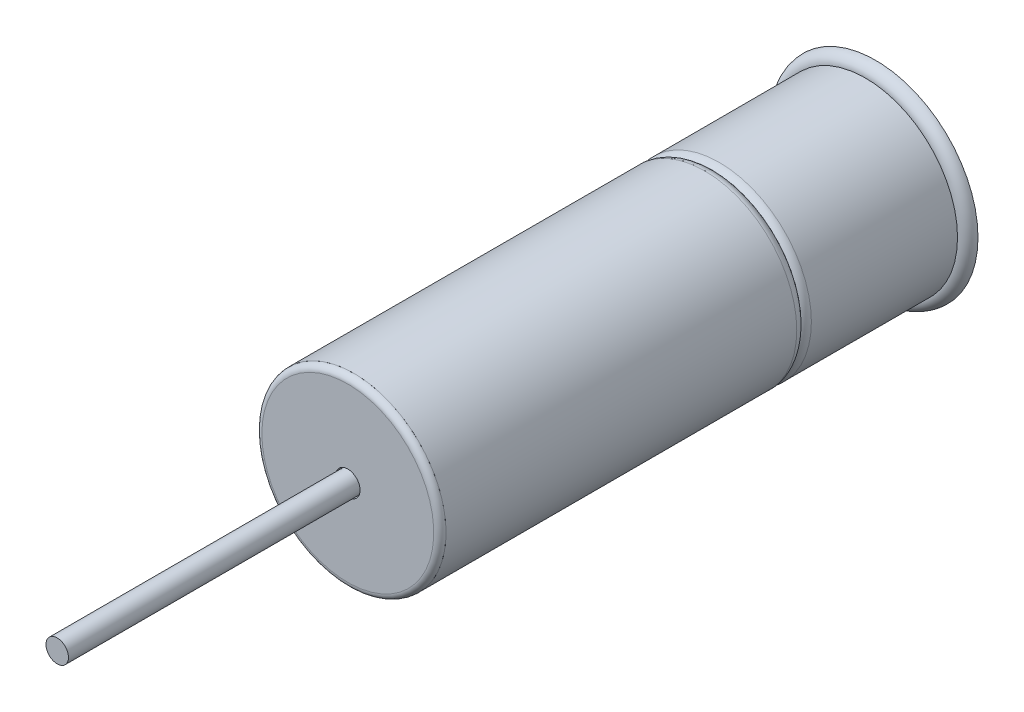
ISO-10303-21;
HEADER;
FILE_DESCRIPTION(('STEP AP214'),'2;1');
FILE_NAME('part.step','',(''),(''),'','','');
FILE_SCHEMA(('AUTOMOTIVE_DESIGN { 1 0 10303 214 1 1 1 1 }'));
ENDSEC;
DATA;
#1=APPLICATION_CONTEXT('core data for automotive mechanical design processes');
#2=APPLICATION_PROTOCOL_DEFINITION('international standard','automotive_design',2000,#1);
#3=PRODUCT_CONTEXT('',#1,'mechanical');
#4=PRODUCT('Part','Part','',(#3));
#5=PRODUCT_RELATED_PRODUCT_CATEGORY('part','',(#4));
#6=PRODUCT_DEFINITION_FORMATION('','',#4);
#7=PRODUCT_DEFINITION_CONTEXT('part definition',#1,'design');
#8=PRODUCT_DEFINITION('design','',#6,#7);
#9=PRODUCT_DEFINITION_SHAPE('','',#8);
#10=(LENGTH_UNIT() NAMED_UNIT(*) SI_UNIT(.MILLI.,.METRE.));
#11=(NAMED_UNIT(*) PLANE_ANGLE_UNIT() SI_UNIT($,.RADIAN.));
#12=(NAMED_UNIT(*) SI_UNIT($,.STERADIAN.) SOLID_ANGLE_UNIT());
#13=UNCERTAINTY_MEASURE_WITH_UNIT(LENGTH_MEASURE(1.E-05),#10,'distance_accuracy_value','');
#14=(GEOMETRIC_REPRESENTATION_CONTEXT(3) GLOBAL_UNCERTAINTY_ASSIGNED_CONTEXT((#13)) GLOBAL_UNIT_ASSIGNED_CONTEXT((#10,
#11,#12)) REPRESENTATION_CONTEXT('',''));
#15=CARTESIAN_POINT('',(0.,0.,0.));
#16=DIRECTION('',(0.,0.,1.));
#17=DIRECTION('',(1.,0.,0.));
#18=AXIS2_PLACEMENT_3D('',#15,#16,#17);
#19=CARTESIAN_POINT('',(0.,0.,55.));
#20=DIRECTION('',(0.,0.,1.));
#21=DIRECTION('',(1.,0.,0.));
#22=AXIS2_PLACEMENT_3D('',#19,#20,#21);
#23=PLANE('',#22);
#24=CARTESIAN_POINT('',(0.,0.,55.));
#25=DIRECTION('',(0.,0.,1.));
#26=DIRECTION('',(1.,0.,0.));
#27=AXIS2_PLACEMENT_3D('',#24,#25,#26);
#28=CIRCLE('',#27,5.5);
#29=CARTESIAN_POINT('',(5.5,0.,55.));
#30=VERTEX_POINT('',#29);
#31=EDGE_CURVE('P0_E17',#30,#30,#28,.T.);
#32=ORIENTED_EDGE('',*,*,#31,.F.);
#33=EDGE_LOOP('',(#32));
#34=FACE_BOUND('',#33,.T.);
#35=ADVANCED_FACE('P0_F14',(#34),#23,.F.);
#36=CARTESIAN_POINT('',(0.,0.,200.));
#37=DIRECTION('',(0.,0.,1.));
#38=DIRECTION('',(1.,0.,0.));
#39=AXIS2_PLACEMENT_3D('',#36,#37,#38);
#40=PLANE('',#39);
#41=CARTESIAN_POINT('',(0.,0.,200.));
#42=DIRECTION('',(0.,0.,1.));
#43=DIRECTION('',(1.,0.,0.));
#44=AXIS2_PLACEMENT_3D('',#41,#42,#43);
#45=CIRCLE('',#44,5.5);
#46=CARTESIAN_POINT('',(5.5,0.,200.));
#47=VERTEX_POINT('',#46);
#48=EDGE_CURVE('P0_E9',#47,#47,#45,.F.);
#49=ORIENTED_EDGE('',*,*,#48,.F.);
#50=EDGE_LOOP('',(#49));
#51=FACE_BOUND('',#50,.T.);
#52=ADVANCED_FACE('P0_F29',(#51),#40,.T.);
#53=CARTESIAN_POINT('',(0.,0.,55.));
#54=DIRECTION('',(0.,0.,1.));
#55=DIRECTION('',(1.,0.,0.));
#56=AXIS2_PLACEMENT_3D('',#53,#54,#55);
#57=CYLINDRICAL_SURFACE('',#56,5.5);
#58=ORIENTED_EDGE('',*,*,#31,.T.);
#59=EDGE_LOOP('',(#58));
#60=FACE_BOUND('',#59,.T.);
#61=ORIENTED_EDGE('',*,*,#48,.T.);
#62=EDGE_LOOP('',(#61));
#63=FACE_BOUND('',#62,.T.);
#64=ADVANCED_FACE('P0_F26',(#60,#63),#57,.T.);
#65=CLOSED_SHELL('',(#35,#52,#64));
#66=MANIFOLD_SOLID_BREP('P0_B1',#65);
#67=CARTESIAN_POINT('',(0.,0.,58.));
#68=DIRECTION('',(0.,0.,1.));
#69=DIRECTION('',(1.,0.,0.));
#70=AXIS2_PLACEMENT_3D('',#67,#68,#69);
#71=PLANE('',#70);
#72=CARTESIAN_POINT('',(0.,0.,58.));
#73=DIRECTION('',(0.,0.,-1.));
#74=DIRECTION('',(-1.,0.,0.));
#75=AXIS2_PLACEMENT_3D('',#72,#73,#74);
#76=CIRCLE('',#75,42.);
#77=CARTESIAN_POINT('',(-42.,0.,58.));
#78=VERTEX_POINT('',#77);
#79=EDGE_CURVE('P1_E51',#78,#78,#76,.T.);
#80=ORIENTED_EDGE('',*,*,#79,.F.);
#81=EDGE_LOOP('',(#80));
#82=FACE_BOUND('',#81,.T.);
#83=CARTESIAN_POINT('',(0.,0.,58.));
#84=DIRECTION('',(0.,0.,1.));
#85=DIRECTION('',(1.,0.,0.));
#86=AXIS2_PLACEMENT_3D('',#83,#84,#85);
#87=CIRCLE('',#86,6.);
#88=CARTESIAN_POINT('',(6.,0.,58.));
#89=VERTEX_POINT('',#88);
#90=EDGE_CURVE('P1_E19',#89,#89,#87,.T.);
#91=ORIENTED_EDGE('',*,*,#90,.F.);
#92=EDGE_LOOP('',(#91));
#93=FACE_BOUND('',#92,.T.);
#94=ADVANCED_FACE('P1_F15',(#82,#93),#71,.T.);
#95=CARTESIAN_POINT('',(0.,0.,55.));
#96=DIRECTION('',(0.,0.,-1.));
#97=DIRECTION('',(-1.,0.,0.));
#98=AXIS2_PLACEMENT_3D('',#95,#96,#97);
#99=TOROIDAL_SURFACE('',#98,42.,3.);
#100=CARTESIAN_POINT('',(0.,0.,55.));
#101=DIRECTION('',(0.,0.,-1.));
#102=DIRECTION('',(-1.,0.,0.));
#103=AXIS2_PLACEMENT_3D('',#100,#101,#102);
#104=CIRCLE('',#103,45.);
#105=CARTESIAN_POINT('',(-45.,0.,55.));
#106=VERTEX_POINT('',#105);
#107=EDGE_CURVE('P1_E23',#106,#106,#104,.F.);
#108=ORIENTED_EDGE('',*,*,#107,.T.);
#109=EDGE_LOOP('',(#108));
#110=FACE_BOUND('',#109,.T.);
#111=ORIENTED_EDGE('',*,*,#79,.T.);
#112=EDGE_LOOP('',(#111));
#113=FACE_BOUND('',#112,.T.);
#114=ADVANCED_FACE('P1_F34',(#110,#113),#99,.T.);
#115=CARTESIAN_POINT('',(0.,0.,55.));
#116=DIRECTION('',(0.,0.,1.));
#117=DIRECTION('',(1.,0.,0.));
#118=AXIS2_PLACEMENT_3D('',#115,#116,#117);
#119=CYLINDRICAL_SURFACE('',#118,6.);
#120=CARTESIAN_POINT('',(0.,0.,55.));
#121=DIRECTION('',(0.,0.,1.));
#122=DIRECTION('',(1.,0.,0.));
#123=AXIS2_PLACEMENT_3D('',#120,#121,#122);
#124=CIRCLE('',#123,6.);
#125=CARTESIAN_POINT('',(6.,0.,55.));
#126=VERTEX_POINT('',#125);
#127=EDGE_CURVE('P1_E10',#126,#126,#124,.F.);
#128=ORIENTED_EDGE('',*,*,#127,.T.);
#129=EDGE_LOOP('',(#128));
#130=FACE_BOUND('',#129,.T.);
#131=ORIENTED_EDGE('',*,*,#90,.T.);
#132=EDGE_LOOP('',(#131));
#133=FACE_BOUND('',#132,.T.);
#134=ADVANCED_FACE('P1_F44',(#130,#133),#119,.F.);
#135=CARTESIAN_POINT('',(0.,0.,55.));
#136=DIRECTION('',(0.,0.,1.));
#137=DIRECTION('',(1.,0.,0.));
#138=AXIS2_PLACEMENT_3D('',#135,#136,#137);
#139=PLANE('',#138);
#140=ORIENTED_EDGE('',*,*,#127,.F.);
#141=EDGE_LOOP('',(#140));
#142=FACE_BOUND('',#141,.T.);
#143=ORIENTED_EDGE('',*,*,#107,.F.);
#144=EDGE_LOOP('',(#143));
#145=FACE_BOUND('',#144,.T.);
#146=ADVANCED_FACE('P1_F68',(#142,#145),#139,.F.);
#147=CLOSED_SHELL('',(#94,#114,#134,#146));
#148=MANIFOLD_SOLID_BREP('P1_B1',#147);
#149=CARTESIAN_POINT('',(0.,0.,-195.));
#150=DIRECTION('',(0.,0.,1.));
#151=DIRECTION('',(1.,0.,0.));
#152=AXIS2_PLACEMENT_3D('',#149,#150,#151);
#153=PLANE('',#152);
#154=CARTESIAN_POINT('',(0.,0.,-195.));
#155=DIRECTION('',(0.,0.,-1.));
#156=DIRECTION('',(1.,0.,0.));
#157=AXIS2_PLACEMENT_3D('',#154,#155,#156);
#158=CIRCLE('',#157,45.);
#159=CARTESIAN_POINT('',(45.,0.,-195.));
#160=VERTEX_POINT('',#159);
#161=EDGE_CURVE('P2_E22',#160,#160,#158,.T.);
#162=ORIENTED_EDGE('',*,*,#161,.F.);
#163=EDGE_LOOP('',(#162));
#164=FACE_BOUND('',#163,.T.);
#165=ADVANCED_FACE('P2_F15',(#164),#153,.T.);
#166=CARTESIAN_POINT('',(0.,0.,-200.));
#167=DIRECTION('',(0.,0.,1.));
#168=DIRECTION('',(1.,0.,0.));
#169=AXIS2_PLACEMENT_3D('',#166,#167,#168);
#170=TOROIDAL_SURFACE('',#169,45.,5.);
#171=ORIENTED_EDGE('',*,*,#161,.T.);
#172=EDGE_LOOP('',(#171));
#173=FACE_BOUND('',#172,.T.);
#174=CARTESIAN_POINT('',(0.,0.,-200.));
#175=DIRECTION('',(0.,0.,1.));
#176=DIRECTION('',(1.,0.,0.));
#177=AXIS2_PLACEMENT_3D('',#174,#175,#176);
#178=CIRCLE('',#177,50.);
#179=CARTESIAN_POINT('',(50.,0.,-200.));
#180=VERTEX_POINT('',#179);
#181=EDGE_CURVE('P2_E10',#180,#180,#178,.T.);
#182=ORIENTED_EDGE('',*,*,#181,.T.);
#183=EDGE_LOOP('',(#182));
#184=FACE_BOUND('',#183,.T.);
#185=ADVANCED_FACE('P2_F29',(#173,#184),#170,.T.);
#186=CARTESIAN_POINT('',(0.,0.,-200.));
#187=DIRECTION('',(0.,0.,1.));
#188=DIRECTION('',(1.,0.,0.));
#189=AXIS2_PLACEMENT_3D('',#186,#187,#188);
#190=PLANE('',#189);
#191=ORIENTED_EDGE('',*,*,#181,.F.);
#192=EDGE_LOOP('',(#191));
#193=FACE_BOUND('',#192,.T.);
#194=ADVANCED_FACE('P2_F46',(#193),#190,.F.);
#195=CLOSED_SHELL('',(#165,#185,#194));
#196=MANIFOLD_SOLID_BREP('P2_B1',#195);
#197=CARTESIAN_POINT('',(0.,0.,-195.));
#198=DIRECTION('',(0.,0.,1.));
#199=DIRECTION('',(1.,0.,0.));
#200=AXIS2_PLACEMENT_3D('',#197,#198,#199);
#201=CYLINDRICAL_SURFACE('',#200,43.5);
#202=CARTESIAN_POINT('',(0.,0.,-195.));
#203=DIRECTION('',(0.,0.,1.));
#204=DIRECTION('',(1.,0.,0.));
#205=AXIS2_PLACEMENT_3D('',#202,#203,#204);
#206=CIRCLE('',#205,43.5);
#207=CARTESIAN_POINT('',(43.5,0.,-195.));
#208=VERTEX_POINT('',#207);
#209=EDGE_CURVE('P3_E23',#208,#208,#206,.F.);
#210=ORIENTED_EDGE('',*,*,#209,.T.);
#211=EDGE_LOOP('',(#210));
#212=FACE_BOUND('',#211,.T.);
#213=CARTESIAN_POINT('',(0.,0.,-120.));
#214=DIRECTION('',(0.,0.,-1.));
#215=DIRECTION('',(0.,1.,0.));
#216=AXIS2_PLACEMENT_3D('',#213,#214,#215);
#217=CIRCLE('',#216,43.5);
#218=CARTESIAN_POINT('',(0.,43.5,-120.));
#219=VERTEX_POINT('',#218);
#220=EDGE_CURVE('P3_E10',#219,#219,#217,.F.);
#221=ORIENTED_EDGE('',*,*,#220,.T.);
#222=EDGE_LOOP('',(#221));
#223=FACE_BOUND('',#222,.T.);
#224=ADVANCED_FACE('P3_F15',(#212,#223),#201,.F.);
#225=CARTESIAN_POINT('',(0.,0.,-195.));
#226=DIRECTION('',(0.,0.,1.));
#227=DIRECTION('',(1.,0.,0.));
#228=AXIS2_PLACEMENT_3D('',#225,#226,#227);
#229=PLANE('',#228);
#230=ORIENTED_EDGE('',*,*,#209,.F.);
#231=EDGE_LOOP('',(#230));
#232=FACE_BOUND('',#231,.T.);
#233=CARTESIAN_POINT('',(0.,0.,-195.));
#234=DIRECTION('',(0.,0.,1.));
#235=DIRECTION('',(1.,0.,0.));
#236=AXIS2_PLACEMENT_3D('',#233,#234,#235);
#237=CIRCLE('',#236,45.);
#238=CARTESIAN_POINT('',(45.,0.,-195.));
#239=VERTEX_POINT('',#238);
#240=EDGE_CURVE('P3_E31',#239,#239,#237,.T.);
#241=ORIENTED_EDGE('',*,*,#240,.F.);
#242=EDGE_LOOP('',(#241));
#243=FACE_BOUND('',#242,.T.);
#244=ADVANCED_FACE('P3_F54',(#232,#243),#229,.F.);
#245=CARTESIAN_POINT('',(0.,0.,-195.));
#246=DIRECTION('',(0.,0.,1.));
#247=DIRECTION('',(1.,0.,0.));
#248=AXIS2_PLACEMENT_3D('',#245,#246,#247);
#249=CYLINDRICAL_SURFACE('',#248,45.);
#250=ORIENTED_EDGE('',*,*,#240,.T.);
#251=EDGE_LOOP('',(#250));
#252=FACE_BOUND('',#251,.T.);
#253=CARTESIAN_POINT('',(0.,0.,-123.570714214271));
#254=DIRECTION('',(0.,0.,1.));
#255=DIRECTION('',(1.,0.,0.));
#256=AXIS2_PLACEMENT_3D('',#253,#254,#255);
#257=CIRCLE('',#256,45.);
#258=CARTESIAN_POINT('',(45.,0.,-123.570714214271));
#259=VERTEX_POINT('',#258);
#260=EDGE_CURVE('P3_E35',#259,#259,#257,.F.);
#261=ORIENTED_EDGE('',*,*,#260,.T.);
#262=EDGE_LOOP('',(#261));
#263=FACE_BOUND('',#262,.T.);
#264=ADVANCED_FACE('P3_F46',(#252,#263),#249,.T.);
#265=CARTESIAN_POINT('',(0.,0.,-123.570714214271));
#266=DIRECTION('',(0.,0.,-1.));
#267=DIRECTION('',(-1.,0.,0.));
#268=AXIS2_PLACEMENT_3D('',#265,#266,#267);
#269=TOROIDAL_SURFACE('',#268,40.,5.);
#270=CARTESIAN_POINT('',(0.,0.,-120.));
#271=DIRECTION('',(0.,0.,-1.));
#272=DIRECTION('',(-1.,0.,0.));
#273=AXIS2_PLACEMENT_3D('',#270,#271,#272);
#274=CIRCLE('',#273,43.5);
#275=CARTESIAN_POINT('',(-43.5,0.,-120.));
#276=VERTEX_POINT('',#275);
#277=EDGE_CURVE('P3_E39',#276,#276,#274,.T.);
#278=ORIENTED_EDGE('',*,*,#277,.T.);
#279=EDGE_LOOP('',(#278));
#280=FACE_BOUND('',#279,.T.);
#281=ORIENTED_EDGE('',*,*,#260,.F.);
#282=EDGE_LOOP('',(#281));
#283=FACE_BOUND('',#282,.T.);
#284=ADVANCED_FACE('P3_F16',(#280,#283),#269,.T.);
#285=OPEN_SHELL('',(#224,#244,#264,#284));
#286=SHELL_BASED_SURFACE_MODEL('P3_B1',(#285));
#287=CARTESIAN_POINT('',(0.,0.,-120.));
#288=DIRECTION('',(0.,0.,1.));
#289=DIRECTION('',(1.,0.,0.));
#290=AXIS2_PLACEMENT_3D('',#287,#288,#289);
#291=CYLINDRICAL_SURFACE('',#290,45.);
#292=CARTESIAN_POINT('',(0.,0.,-116.429285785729));
#293=DIRECTION('',(0.,0.,1.));
#294=DIRECTION('',(1.,0.,0.));
#295=AXIS2_PLACEMENT_3D('',#292,#293,#294);
#296=CIRCLE('',#295,45.);
#297=CARTESIAN_POINT('',(45.,0.,-116.429285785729));
#298=VERTEX_POINT('',#297);
#299=EDGE_CURVE('P4_E21',#298,#298,#296,.T.);
#300=ORIENTED_EDGE('',*,*,#299,.T.);
#301=EDGE_LOOP('',(#300));
#302=FACE_BOUND('',#301,.T.);
#303=CARTESIAN_POINT('',(0.,0.,55.));
#304=DIRECTION('',(0.,0.,1.));
#305=DIRECTION('',(1.,0.,0.));
#306=AXIS2_PLACEMENT_3D('',#303,#304,#305);
#307=CIRCLE('',#306,45.);
#308=CARTESIAN_POINT('',(45.,0.,55.));
#309=VERTEX_POINT('',#308);
#310=EDGE_CURVE('P4_E10',#309,#309,#307,.F.);
#311=ORIENTED_EDGE('',*,*,#310,.T.);
#312=EDGE_LOOP('',(#311));
#313=FACE_BOUND('',#312,.T.);
#314=ADVANCED_FACE('P4_F15',(#302,#313),#291,.T.);
#315=CARTESIAN_POINT('',(0.,0.,55.));
#316=DIRECTION('',(0.,0.,1.));
#317=DIRECTION('',(1.,0.,0.));
#318=AXIS2_PLACEMENT_3D('',#315,#316,#317);
#319=PLANE('',#318);
#320=CARTESIAN_POINT('',(0.,0.,55.));
#321=DIRECTION('',(0.,0.,1.));
#322=DIRECTION('',(1.,0.,0.));
#323=AXIS2_PLACEMENT_3D('',#320,#321,#322);
#324=CIRCLE('',#323,43.5);
#325=CARTESIAN_POINT('',(43.5,0.,55.));
#326=VERTEX_POINT('',#325);
#327=EDGE_CURVE('P4_E18',#326,#326,#324,.F.);
#328=ORIENTED_EDGE('',*,*,#327,.T.);
#329=EDGE_LOOP('',(#328));
#330=FACE_BOUND('',#329,.T.);
#331=ORIENTED_EDGE('',*,*,#310,.F.);
#332=EDGE_LOOP('',(#331));
#333=FACE_BOUND('',#332,.T.);
#334=ADVANCED_FACE('P4_F43',(#330,#333),#319,.T.);
#335=CARTESIAN_POINT('',(0.,0.,-116.429285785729));
#336=DIRECTION('',(0.,0.,1.));
#337=DIRECTION('',(-1.,0.,0.));
#338=AXIS2_PLACEMENT_3D('',#335,#336,#337);
#339=TOROIDAL_SURFACE('',#338,40.,5.);
#340=CARTESIAN_POINT('',(0.,0.,-120.));
#341=DIRECTION('',(0.,0.,1.));
#342=DIRECTION('',(-1.,0.,0.));
#343=AXIS2_PLACEMENT_3D('',#340,#341,#342);
#344=CIRCLE('',#343,43.5);
#345=CARTESIAN_POINT('',(-43.5,0.,-120.));
#346=VERTEX_POINT('',#345);
#347=EDGE_CURVE('P4_E33',#346,#346,#344,.T.);
#348=ORIENTED_EDGE('',*,*,#347,.T.);
#349=EDGE_LOOP('',(#348));
#350=FACE_BOUND('',#349,.T.);
#351=ORIENTED_EDGE('',*,*,#299,.F.);
#352=EDGE_LOOP('',(#351));
#353=FACE_BOUND('',#352,.T.);
#354=ADVANCED_FACE('P4_F40',(#350,#353),#339,.T.);
#355=CARTESIAN_POINT('',(0.,0.,-120.));
#356=DIRECTION('',(0.,0.,1.));
#357=DIRECTION('',(1.,0.,0.));
#358=AXIS2_PLACEMENT_3D('',#355,#356,#357);
#359=CYLINDRICAL_SURFACE('',#358,43.5);
#360=ORIENTED_EDGE('',*,*,#327,.F.);
#361=EDGE_LOOP('',(#360));
#362=FACE_BOUND('',#361,.T.);
#363=CARTESIAN_POINT('',(0.,0.,-120.));
#364=DIRECTION('',(0.,0.,-1.));
#365=DIRECTION('',(0.,1.,0.));
#366=AXIS2_PLACEMENT_3D('',#363,#364,#365);
#367=CIRCLE('',#366,43.5);
#368=CARTESIAN_POINT('',(0.,43.5,-120.));
#369=VERTEX_POINT('',#368);
#370=EDGE_CURVE('P4_E29',#369,#369,#367,.T.);
#371=ORIENTED_EDGE('',*,*,#370,.T.);
#372=EDGE_LOOP('',(#371));
#373=FACE_BOUND('',#372,.T.);
#374=ADVANCED_FACE('P4_F16',(#362,#373),#359,.F.);
#375=OPEN_SHELL('',(#314,#334,#354,#374));
#376=SHELL_BASED_SURFACE_MODEL('P4_B1',(#375));
#377=ADVANCED_BREP_SHAPE_REPRESENTATION('',(#18,#66,#148,#196),#14);
#378=MANIFOLD_SURFACE_SHAPE_REPRESENTATION('',(#18,#286,#376),#14);
#379=SHAPE_REPRESENTATION('',(#18),#14);
#380=SHAPE_DEFINITION_REPRESENTATION(#9,#379);
#381=SHAPE_REPRESENTATION_RELATIONSHIP('','',#379,#377);
#382=SHAPE_REPRESENTATION_RELATIONSHIP('','',#379,#378);
ENDSEC;
END-ISO-10303-21;
